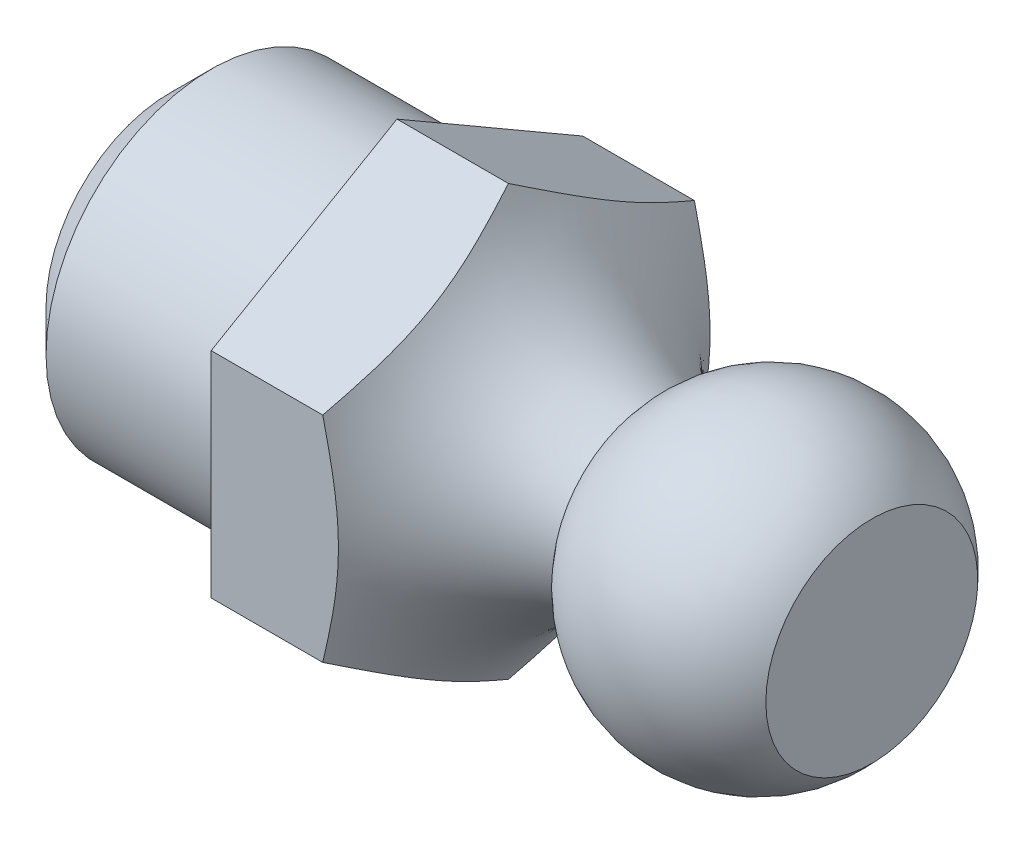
from build123d import *

# Parameters (mm, degrees)
GEWINDEFASE_SIZE                = 1
SCHL_SSELFL_CHE_SW9_R           = 8.995476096
SCHNITT_LINEAR_AUSTRAGEN1_DEPTH = 3.3


with BuildPart() as part:
    # Grundk_rper → Basis-Rotation (revolve)
    with BuildSketch(Plane.XY, mode=Mode.PRIVATE) as basis_rotation_sk:
        with BuildLine():
            Line((0, 0), (0, 4))
            Line((0, 4), (5.5, 4))
            Line((5.5, 4), (5.5, 5.2))
            Line((5.5, 5.2), (8.2, 5.2))
            ThreePointArc((8.2, 5.2), (9.548747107, 3.335719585), (11.5, 2.116181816))
            ThreePointArc((11.5, 2.116181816), (14.134694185, 3.75047511), (17, 2.566181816))
            Line((17, 2.566181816), (17, 0))
            Line((17, 0), (0, 0))
        make_face()
    revolve(basis_rotation_sk.sketch.rotate(Axis((-3.375568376, 0, 0), (1, 0, 0)), 90), axis=Axis((-3.375568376, 0, 0), (1, 0, 0)))

    # Gewindefase
    gewindefase_edges = [part.edges().sort_by_distance(p)[0] for p in [
        (0, 0, -4),
    ]]
    chamfer(gewindefase_edges, length=GEWINDEFASE_SIZE)

    # Schl_sselfl_che-SW9 → Schnitt-Linear austragen1 (cut)
    with BuildSketch(Plane.ZY.offset(-5.5)):
        Circle(SCHL_SSELFL_CHE_SW9_R)
        Polygon((0, 5.2), (4.5, 2.594237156), (4.5, -2.594237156), (0, -5.2), (-4.5, -2.594237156), (-4.5, 2.594237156), align=None, mode=Mode.SUBTRACT)
    extrude(amount=-SCHNITT_LINEAR_AUSTRAGEN1_DEPTH, mode=Mode.SUBTRACT)


solid = part.part
